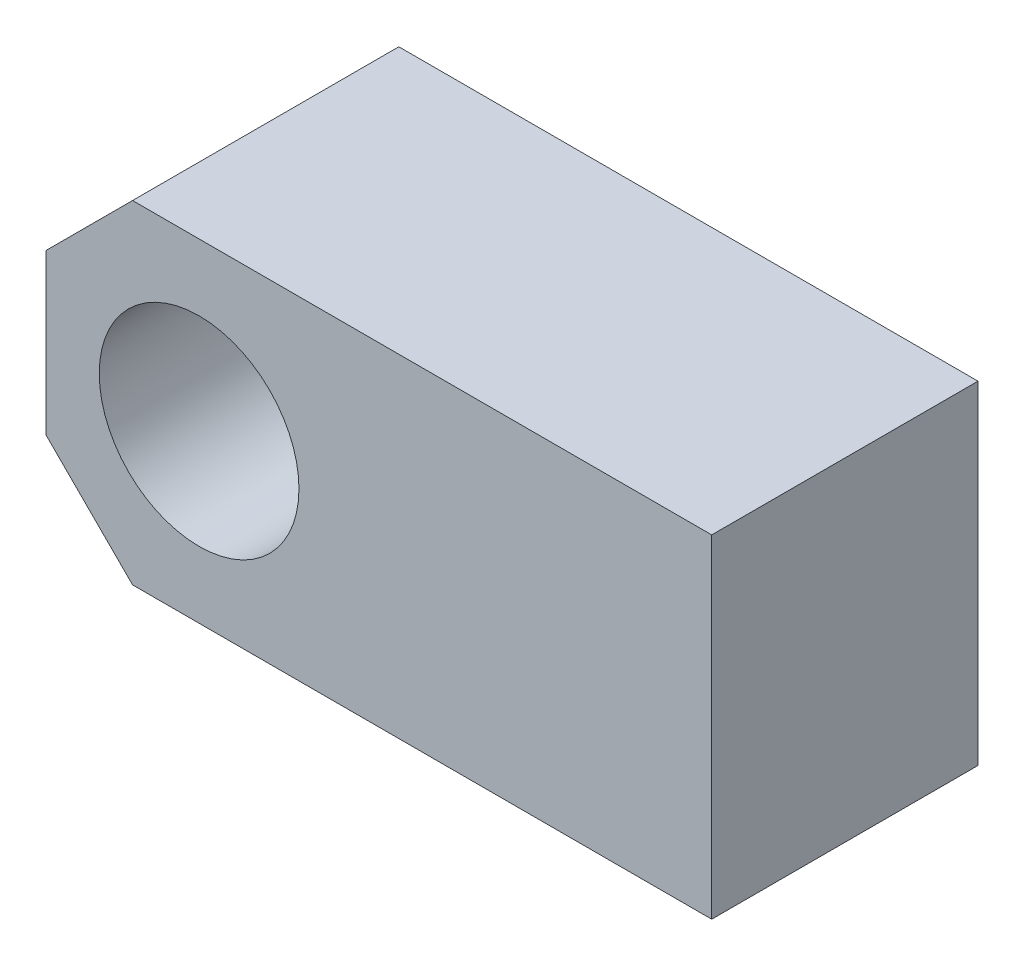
from build123d import *

# Parameters (mm, degrees)
ESQUISSE1_W           = 100
ESQUISSE1_H           = 50
ESQUISSE1_R           = 15
BOSS_EXTRU_1_DEPTH    = 40
CHANFREIN1_SIZE       = 13
TROU_TARAUD_M81_D     = 6.8
TROU_TARAUD_M81_DEPTH = 22.25
TROU_TARAUD_M81_TIP   = 2.042926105


with BuildPart() as part:
    # Esquisse1 → Boss.-Extru.1 (new body)
    with BuildSketch(Plane.XY):
        with Locations((-50, 25)):
            Rectangle(ESQUISSE1_W, ESQUISSE1_H)
        with Locations((-77, 25)):
            Circle(ESQUISSE1_R, mode=Mode.SUBTRACT)
    extrude(amount=BOSS_EXTRU_1_DEPTH)

    # Chanfrein1
    chanfrein1_edges = [part.edges().sort_by_distance(p)[0] for p in [
        (-100, 0, 20),
        (-100, 50, 20),
    ]]
    chamfer(chanfrein1_edges, length=CHANFREIN1_SIZE)

    # Trou taraud_ M81
    with Locations(Plane(origin=(0, 0, 0), x_dir=(-1, 0, 0), z_dir=(0, -1, 0))):
        with Locations((77, -20)):
            Hole(TROU_TARAUD_M81_D / 2, depth=TROU_TARAUD_M81_DEPTH)
            with Locations((0, 0, -(TROU_TARAUD_M81_DEPTH + TROU_TARAUD_M81_TIP / 2))):  # 118° drill point
                Cone(0, TROU_TARAUD_M81_D / 2, TROU_TARAUD_M81_TIP, mode=Mode.SUBTRACT)


solid = part.part
